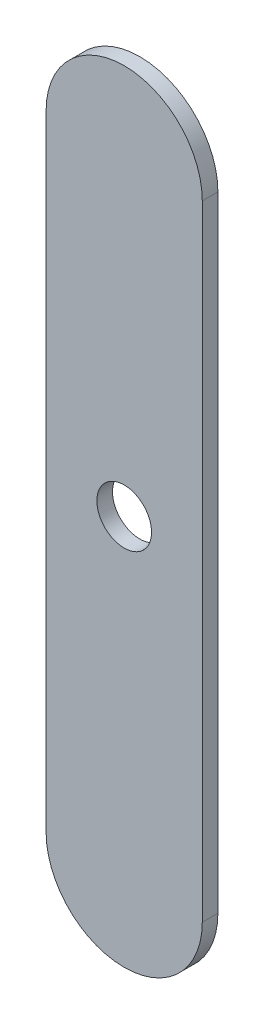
from build123d import *

# Parameters (mm, degrees)
SKETCH1_R      = 1.75
EXTRUDE1_DEPTH = 1


with BuildPart() as part:
    # Sketch1 → Extrude1 (new body)
    with BuildSketch(Plane.XY):
        with BuildLine():
            Line((5, 40), (5, 0))
            ThreePointArc((5, 0), (0, -5), (-5, 0))
            Line((-5, 0), (-5, 40))
            ThreePointArc((-5, 40), (0, 45), (5, 40))
        make_face()
        with Locations((0, 20)):
            Circle(SKETCH1_R, mode=Mode.SUBTRACT)
    extrude(amount=EXTRUDE1_DEPTH)


solid = part.part
